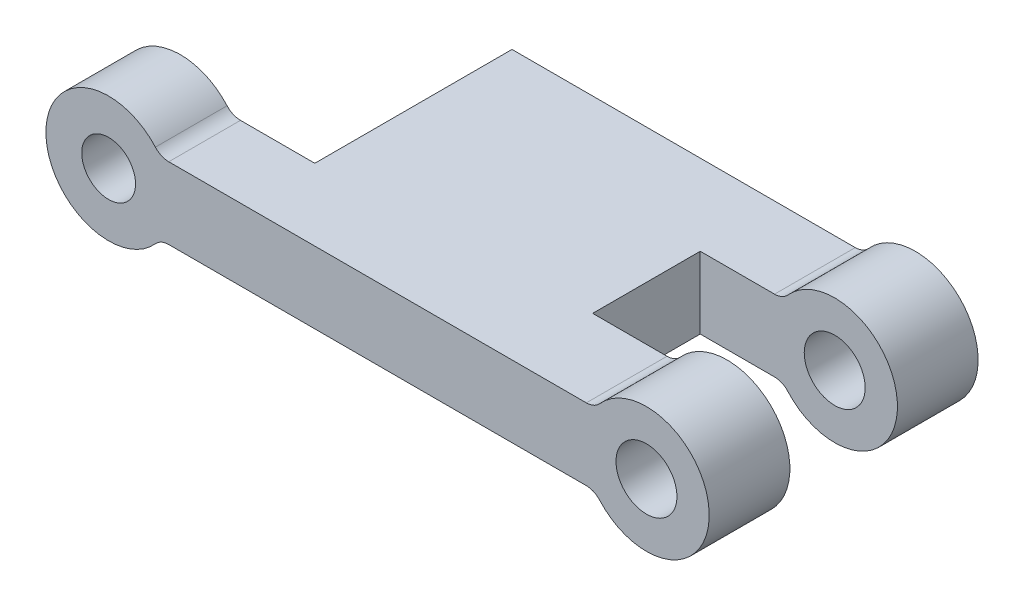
ISO-10303-21;
HEADER;
FILE_DESCRIPTION(('STEP AP214'),'2;1');
FILE_NAME('part.step','',(''),(''),'','','');
FILE_SCHEMA(('AUTOMOTIVE_DESIGN { 1 0 10303 214 1 1 1 1 }'));
ENDSEC;
DATA;
#1=APPLICATION_CONTEXT('core data for automotive mechanical design processes');
#2=APPLICATION_PROTOCOL_DEFINITION('international standard','automotive_design',2000,#1);
#3=PRODUCT_CONTEXT('',#1,'mechanical');
#4=PRODUCT('Part','Part','',(#3));
#5=PRODUCT_RELATED_PRODUCT_CATEGORY('part','',(#4));
#6=PRODUCT_DEFINITION_FORMATION('','',#4);
#7=PRODUCT_DEFINITION_CONTEXT('part definition',#1,'design');
#8=PRODUCT_DEFINITION('design','',#6,#7);
#9=PRODUCT_DEFINITION_SHAPE('','',#8);
#10=(LENGTH_UNIT() NAMED_UNIT(*) SI_UNIT(.MILLI.,.METRE.));
#11=(NAMED_UNIT(*) PLANE_ANGLE_UNIT() SI_UNIT($,.RADIAN.));
#12=(NAMED_UNIT(*) SI_UNIT($,.STERADIAN.) SOLID_ANGLE_UNIT());
#13=UNCERTAINTY_MEASURE_WITH_UNIT(LENGTH_MEASURE(1.E-05),#10,'distance_accuracy_value','');
#14=(GEOMETRIC_REPRESENTATION_CONTEXT(3) GLOBAL_UNCERTAINTY_ASSIGNED_CONTEXT((#13)) GLOBAL_UNIT_ASSIGNED_CONTEXT((#10,
#11,#12)) REPRESENTATION_CONTEXT('',''));
#15=CARTESIAN_POINT('',(0.,0.,0.));
#16=DIRECTION('',(0.,0.,1.));
#17=DIRECTION('',(1.,0.,0.));
#18=AXIS2_PLACEMENT_3D('',#15,#16,#17);
#19=CARTESIAN_POINT('',(22.5,-2.,-11.));
#20=DIRECTION('',(-1.,0.,0.));
#21=DIRECTION('',(0.,0.,1.));
#22=AXIS2_PLACEMENT_3D('',#19,#20,#21);
#23=PLANE('',#22);
#24=DIRECTION('',(0.,0.,1.));
#25=VECTOR('',#24,1.);
#26=CARTESIAN_POINT('',(22.5,2.,-11.));
#27=LINE('',#26,#25);
#28=CARTESIAN_POINT('',(22.5,2.,-6.5));
#29=VERTEX_POINT('',#28);
#30=CARTESIAN_POINT('',(22.5,2.,-0.5));
#31=VERTEX_POINT('',#30);
#32=EDGE_CURVE('E242',#29,#31,#27,.T.);
#33=ORIENTED_EDGE('',*,*,#32,.T.);
#34=DIRECTION('',(0.,1.,0.));
#35=VECTOR('',#34,1.);
#36=CARTESIAN_POINT('',(22.5,2.,-0.5));
#37=LINE('',#36,#35);
#38=CARTESIAN_POINT('',(22.5,-2.,-0.5));
#39=VERTEX_POINT('',#38);
#40=EDGE_CURVE('E183',#39,#31,#37,.T.);
#41=ORIENTED_EDGE('',*,*,#40,.F.);
#42=DIRECTION('',(0.,0.,1.));
#43=VECTOR('',#42,1.);
#44=CARTESIAN_POINT('',(22.5,-2.,-11.));
#45=LINE('',#44,#43);
#46=CARTESIAN_POINT('',(22.5,-2.,-6.5));
#47=VERTEX_POINT('',#46);
#48=EDGE_CURVE('E182',#47,#39,#45,.T.);
#49=ORIENTED_EDGE('',*,*,#48,.F.);
#50=DIRECTION('',(0.,1.,0.));
#51=VECTOR('',#50,1.);
#52=CARTESIAN_POINT('',(22.5,2.,-6.5));
#53=LINE('',#52,#51);
#54=EDGE_CURVE('E209',#47,#29,#53,.T.);
#55=ORIENTED_EDGE('',*,*,#54,.T.);
#56=EDGE_LOOP('',(#33,#41,#49,#55));
#57=FACE_BOUND('',#56,.T.);
#58=ADVANCED_FACE('F35',(#57),#23,.F.);
#59=CARTESIAN_POINT('',(3.35410196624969,-3.,0.));
#60=DIRECTION('',(0.,0.,1.));
#61=DIRECTION('',(1.,0.,0.));
#62=AXIS2_PLACEMENT_3D('',#59,#60,#61);
#63=PLANE('',#62);
#64=CARTESIAN_POINT('',(0.,0.,0.));
#65=DIRECTION('',(0.,0.,1.));
#66=DIRECTION('',(1.,0.,0.));
#67=AXIS2_PLACEMENT_3D('',#64,#65,#66);
#68=CIRCLE('',#67,1.5);
#69=CARTESIAN_POINT('',(1.5,0.,0.));
#70=VERTEX_POINT('',#69);
#71=EDGE_CURVE('E250',#70,#70,#68,.T.);
#72=ORIENTED_EDGE('',*,*,#71,.T.);
#73=EDGE_LOOP('',(#72));
#74=FACE_BOUND('',#73,.T.);
#75=DIRECTION('',(0.,1.,0.));
#76=VECTOR('',#75,1.);
#77=CARTESIAN_POINT('',(7.50000000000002,-2.,0.));
#78=LINE('',#77,#76);
#79=CARTESIAN_POINT('',(7.50000000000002,-2.,0.));
#80=VERTEX_POINT('',#79);
#81=CARTESIAN_POINT('',(7.50000000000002,2.,0.));
#82=VERTEX_POINT('',#81);
#83=EDGE_CURVE('E51',#80,#82,#78,.T.);
#84=ORIENTED_EDGE('',*,*,#83,.F.);
#85=DIRECTION('',(1.,0.,0.));
#86=VECTOR('',#85,1.);
#87=CARTESIAN_POINT('',(3.35410196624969,-2.,0.));
#88=LINE('',#87,#86);
#89=CARTESIAN_POINT('',(3.35410196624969,-2.,0.));
#90=VERTEX_POINT('',#89);
#91=EDGE_CURVE('E136',#90,#80,#88,.T.);
#92=ORIENTED_EDGE('',*,*,#91,.F.);
#93=CARTESIAN_POINT('',(3.35410196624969,-3.,0.));
#94=DIRECTION('',(0.,0.,-1.));
#95=DIRECTION('',(1.,0.,0.));
#96=AXIS2_PLACEMENT_3D('',#93,#94,#95);
#97=CIRCLE('',#96,1.);
#98=CARTESIAN_POINT('',(2.60874597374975,-2.33333333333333,0.));
#99=VERTEX_POINT('',#98);
#100=EDGE_CURVE('E133',#99,#90,#97,.T.);
#101=ORIENTED_EDGE('',*,*,#100,.F.);
#102=CARTESIAN_POINT('',(0.,0.,0.));
#103=DIRECTION('',(0.,0.,1.));
#104=DIRECTION('',(1.,0.,0.));
#105=AXIS2_PLACEMENT_3D('',#102,#103,#104);
#106=CIRCLE('',#105,3.5);
#107=CARTESIAN_POINT('',(2.60874597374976,2.33333333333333,0.));
#108=VERTEX_POINT('',#107);
#109=EDGE_CURVE('E80',#108,#99,#106,.T.);
#110=ORIENTED_EDGE('',*,*,#109,.F.);
#111=CARTESIAN_POINT('',(3.35410196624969,3.,0.));
#112=DIRECTION('',(0.,0.,-1.));
#113=DIRECTION('',(-1.,0.,0.));
#114=AXIS2_PLACEMENT_3D('',#111,#112,#113);
#115=CIRCLE('',#114,1.);
#116=CARTESIAN_POINT('',(3.35410196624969,2.,0.));
#117=VERTEX_POINT('',#116);
#118=EDGE_CURVE('E140',#117,#108,#115,.T.);
#119=ORIENTED_EDGE('',*,*,#118,.F.);
#120=DIRECTION('',(-1.,0.,0.));
#121=VECTOR('',#120,1.);
#122=CARTESIAN_POINT('',(3.35410196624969,2.,0.));
#123=LINE('',#122,#121);
#124=EDGE_CURVE('E121',#82,#117,#123,.T.);
#125=ORIENTED_EDGE('',*,*,#124,.F.);
#126=EDGE_LOOP('',(#84,#92,#101,#110,#119,#125));
#127=FACE_BOUND('',#126,.T.);
#128=ADVANCED_FACE('F343',(#74,#127),#63,.F.);
#129=CARTESIAN_POINT('',(3.35410196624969,-3.,4.));
#130=DIRECTION('',(0.,0.,1.));
#131=DIRECTION('',(1.,0.,0.));
#132=AXIS2_PLACEMENT_3D('',#129,#130,#131);
#133=PLANE('',#132);
#134=CARTESIAN_POINT('',(30.,0.,4.));
#135=DIRECTION('',(0.,0.,1.));
#136=DIRECTION('',(1.,0.,0.));
#137=AXIS2_PLACEMENT_3D('',#134,#135,#136);
#138=CIRCLE('',#137,1.7);
#139=CARTESIAN_POINT('',(31.7,0.,4.));
#140=VERTEX_POINT('',#139);
#141=EDGE_CURVE('E552',#140,#140,#138,.T.);
#142=ORIENTED_EDGE('',*,*,#141,.F.);
#143=EDGE_LOOP('',(#142));
#144=FACE_BOUND('',#143,.T.);
#145=CARTESIAN_POINT('',(3.35410196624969,-3.,4.));
#146=DIRECTION('',(0.,0.,-1.));
#147=DIRECTION('',(1.,0.,0.));
#148=AXIS2_PLACEMENT_3D('',#145,#146,#147);
#149=CIRCLE('',#148,1.);
#150=CARTESIAN_POINT('',(2.60874597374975,-2.33333333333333,4.));
#151=VERTEX_POINT('',#150);
#152=CARTESIAN_POINT('',(3.35410196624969,-2.,4.));
#153=VERTEX_POINT('',#152);
#154=EDGE_CURVE('E143',#151,#153,#149,.T.);
#155=ORIENTED_EDGE('',*,*,#154,.T.);
#156=DIRECTION('',(1.,0.,0.));
#157=VECTOR('',#156,1.);
#158=CARTESIAN_POINT('',(3.35410196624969,-2.,4.));
#159=LINE('',#158,#157);
#160=CARTESIAN_POINT('',(26.6458980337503,-2.,4.));
#161=VERTEX_POINT('',#160);
#162=EDGE_CURVE('E88',#153,#161,#159,.T.);
#163=ORIENTED_EDGE('',*,*,#162,.T.);
#164=CARTESIAN_POINT('',(26.6458980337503,-3.,4.));
#165=DIRECTION('',(0.,0.,-1.));
#166=DIRECTION('',(-1.,0.,0.));
#167=AXIS2_PLACEMENT_3D('',#164,#165,#166);
#168=CIRCLE('',#167,1.);
#169=CARTESIAN_POINT('',(27.3912540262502,-2.33333333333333,4.));
#170=VERTEX_POINT('',#169);
#171=EDGE_CURVE('E164',#161,#170,#168,.T.);
#172=ORIENTED_EDGE('',*,*,#171,.T.);
#173=CARTESIAN_POINT('',(30.,0.,4.));
#174=DIRECTION('',(0.,0.,1.));
#175=DIRECTION('',(1.,0.,0.));
#176=AXIS2_PLACEMENT_3D('',#173,#174,#175);
#177=CIRCLE('',#176,3.5);
#178=CARTESIAN_POINT('',(27.3912540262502,2.33333333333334,4.));
#179=VERTEX_POINT('',#178);
#180=EDGE_CURVE('E258',#170,#179,#177,.T.);
#181=ORIENTED_EDGE('',*,*,#180,.T.);
#182=CARTESIAN_POINT('',(26.6458980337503,3.,4.));
#183=DIRECTION('',(0.,0.,-1.));
#184=DIRECTION('',(1.,0.,0.));
#185=AXIS2_PLACEMENT_3D('',#182,#183,#184);
#186=CIRCLE('',#185,1.);
#187=CARTESIAN_POINT('',(26.6458980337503,2.,4.));
#188=VERTEX_POINT('',#187);
#189=EDGE_CURVE('E112',#179,#188,#186,.T.);
#190=ORIENTED_EDGE('',*,*,#189,.T.);
#191=DIRECTION('',(-1.,0.,0.));
#192=VECTOR('',#191,1.);
#193=CARTESIAN_POINT('',(3.35410196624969,2.,4.));
#194=LINE('',#193,#192);
#195=CARTESIAN_POINT('',(3.35410196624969,2.,4.));
#196=VERTEX_POINT('',#195);
#197=EDGE_CURVE('E104',#188,#196,#194,.T.);
#198=ORIENTED_EDGE('',*,*,#197,.T.);
#199=CARTESIAN_POINT('',(3.35410196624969,3.,4.));
#200=DIRECTION('',(0.,0.,-1.));
#201=DIRECTION('',(-1.,0.,0.));
#202=AXIS2_PLACEMENT_3D('',#199,#200,#201);
#203=CIRCLE('',#202,1.);
#204=CARTESIAN_POINT('',(2.60874597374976,2.33333333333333,4.));
#205=VERTEX_POINT('',#204);
#206=EDGE_CURVE('E109',#196,#205,#203,.T.);
#207=ORIENTED_EDGE('',*,*,#206,.T.);
#208=CARTESIAN_POINT('',(0.,0.,4.));
#209=DIRECTION('',(0.,0.,1.));
#210=DIRECTION('',(1.,0.,0.));
#211=AXIS2_PLACEMENT_3D('',#208,#209,#210);
#212=CIRCLE('',#211,3.5);
#213=EDGE_CURVE('E60',#205,#151,#212,.T.);
#214=ORIENTED_EDGE('',*,*,#213,.T.);
#215=EDGE_LOOP('',(#155,#163,#172,#181,#190,#198,#207,#214));
#216=FACE_BOUND('',#215,.T.);
#217=CARTESIAN_POINT('',(0.,0.,4.));
#218=DIRECTION('',(0.,0.,1.));
#219=DIRECTION('',(1.,0.,0.));
#220=AXIS2_PLACEMENT_3D('',#217,#218,#219);
#221=CIRCLE('',#220,1.5);
#222=CARTESIAN_POINT('',(1.5,0.,4.));
#223=VERTEX_POINT('',#222);
#224=EDGE_CURVE('E137',#223,#223,#221,.T.);
#225=ORIENTED_EDGE('',*,*,#224,.F.);
#226=EDGE_LOOP('',(#225));
#227=FACE_BOUND('',#226,.T.);
#228=ADVANCED_FACE('F106',(#144,#216,#227),#133,.T.);
#229=CARTESIAN_POINT('',(3.35410196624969,-3.,4.));
#230=DIRECTION('',(0.,0.,-1.));
#231=DIRECTION('',(-1.,0.,0.));
#232=AXIS2_PLACEMENT_3D('',#229,#230,#231);
#233=CYLINDRICAL_SURFACE('',#232,1.);
#234=ORIENTED_EDGE('',*,*,#100,.T.);
#235=DIRECTION('',(0.,0.,-1.));
#236=VECTOR('',#235,1.);
#237=CARTESIAN_POINT('',(3.35410196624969,-2.,4.));
#238=LINE('',#237,#236);
#239=EDGE_CURVE('E11',#153,#90,#238,.T.);
#240=ORIENTED_EDGE('',*,*,#239,.F.);
#241=ORIENTED_EDGE('',*,*,#154,.F.);
#242=DIRECTION('',(0.,0.,-1.));
#243=VECTOR('',#242,1.);
#244=CARTESIAN_POINT('',(2.60874597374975,-2.33333333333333,4.));
#245=LINE('',#244,#243);
#246=EDGE_CURVE('E129',#151,#99,#245,.T.);
#247=ORIENTED_EDGE('',*,*,#246,.T.);
#248=EDGE_LOOP('',(#234,#240,#241,#247));
#249=FACE_BOUND('',#248,.T.);
#250=ADVANCED_FACE('F37',(#249),#233,.F.);
#251=CARTESIAN_POINT('',(3.35410196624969,-2.,4.));
#252=DIRECTION('',(0.,1.,0.));
#253=DIRECTION('',(0.,0.,1.));
#254=AXIS2_PLACEMENT_3D('',#251,#252,#253);
#255=PLANE('',#254);
#256=ORIENTED_EDGE('',*,*,#91,.T.);
#257=DIRECTION('',(0.,0.,1.));
#258=VECTOR('',#257,1.);
#259=CARTESIAN_POINT('',(7.50000000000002,-2.,-11.));
#260=LINE('',#259,#258);
#261=CARTESIAN_POINT('',(7.50000000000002,-2.,-11.));
#262=VERTEX_POINT('',#261);
#263=EDGE_CURVE('E247',#262,#80,#260,.T.);
#264=ORIENTED_EDGE('',*,*,#263,.F.);
#265=DIRECTION('',(-1.,0.,0.));
#266=VECTOR('',#265,1.);
#267=CARTESIAN_POINT('',(7.50000000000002,-2.,-11.));
#268=LINE('',#267,#266);
#269=CARTESIAN_POINT('',(26.6458980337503,-2.,-11.));
#270=VERTEX_POINT('',#269);
#271=EDGE_CURVE('E231',#270,#262,#268,.T.);
#272=ORIENTED_EDGE('',*,*,#271,.F.);
#273=DIRECTION('',(0.,0.,-1.));
#274=VECTOR('',#273,1.);
#275=CARTESIAN_POINT('',(26.6458980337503,-2.,-6.5));
#276=LINE('',#275,#274);
#277=CARTESIAN_POINT('',(26.6458980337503,-2.,-6.5));
#278=VERTEX_POINT('',#277);
#279=EDGE_CURVE('E220',#278,#270,#276,.T.);
#280=ORIENTED_EDGE('',*,*,#279,.F.);
#281=DIRECTION('',(-1.,0.,0.));
#282=VECTOR('',#281,1.);
#283=CARTESIAN_POINT('',(22.5,-2.,-6.5));
#284=LINE('',#283,#282);
#285=EDGE_CURVE('E207',#278,#47,#284,.T.);
#286=ORIENTED_EDGE('',*,*,#285,.T.);
#287=ORIENTED_EDGE('',*,*,#48,.T.);
#288=DIRECTION('',(-1.,0.,0.));
#289=VECTOR('',#288,1.);
#290=CARTESIAN_POINT('',(22.5,-2.,-0.5));
#291=LINE('',#290,#289);
#292=CARTESIAN_POINT('',(26.6458980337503,-2.,-0.5));
#293=VERTEX_POINT('',#292);
#294=EDGE_CURVE('E172',#293,#39,#291,.T.);
#295=ORIENTED_EDGE('',*,*,#294,.F.);
#296=DIRECTION('',(0.,0.,-1.));
#297=VECTOR('',#296,1.);
#298=CARTESIAN_POINT('',(26.6458980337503,-2.,4.));
#299=LINE('',#298,#297);
#300=EDGE_CURVE('E44',#161,#293,#299,.T.);
#301=ORIENTED_EDGE('',*,*,#300,.F.);
#302=ORIENTED_EDGE('',*,*,#162,.F.);
#303=ORIENTED_EDGE('',*,*,#239,.T.);
#304=EDGE_LOOP('',(#256,#264,#272,#280,#286,#287,#295,#301,#302,#303));
#305=FACE_BOUND('',#304,.T.);
#306=ADVANCED_FACE('F179',(#305),#255,.F.);
#307=CARTESIAN_POINT('',(26.6458980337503,-3.,4.));
#308=DIRECTION('',(0.,0.,-1.));
#309=DIRECTION('',(-1.,0.,0.));
#310=AXIS2_PLACEMENT_3D('',#307,#308,#309);
#311=CYLINDRICAL_SURFACE('',#310,1.);
#312=ORIENTED_EDGE('',*,*,#300,.T.);
#313=CARTESIAN_POINT('',(26.6458980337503,-3.,-0.5));
#314=DIRECTION('',(0.,0.,1.));
#315=DIRECTION('',(-1.,0.,0.));
#316=AXIS2_PLACEMENT_3D('',#313,#314,#315);
#317=CIRCLE('',#316,1.);
#318=CARTESIAN_POINT('',(27.3912540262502,-2.33333333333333,-0.5));
#319=VERTEX_POINT('',#318);
#320=EDGE_CURVE('E162',#319,#293,#317,.T.);
#321=ORIENTED_EDGE('',*,*,#320,.F.);
#322=DIRECTION('',(0.,0.,-1.));
#323=VECTOR('',#322,1.);
#324=CARTESIAN_POINT('',(27.3912540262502,-2.33333333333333,4.));
#325=LINE('',#324,#323);
#326=EDGE_CURVE('E150',#170,#319,#325,.T.);
#327=ORIENTED_EDGE('',*,*,#326,.F.);
#328=ORIENTED_EDGE('',*,*,#171,.F.);
#329=EDGE_LOOP('',(#312,#321,#327,#328));
#330=FACE_BOUND('',#329,.T.);
#331=ADVANCED_FACE('F159',(#330),#311,.F.);
#332=CARTESIAN_POINT('',(30.,0.,4.));
#333=DIRECTION('',(0.,0.,-1.));
#334=DIRECTION('',(-1.,0.,0.));
#335=AXIS2_PLACEMENT_3D('',#332,#333,#334);
#336=CYLINDRICAL_SURFACE('',#335,3.5);
#337=ORIENTED_EDGE('',*,*,#326,.T.);
#338=CARTESIAN_POINT('',(30.,0.,-0.5));
#339=DIRECTION('',(0.,0.,-1.));
#340=DIRECTION('',(-1.,0.,0.));
#341=AXIS2_PLACEMENT_3D('',#338,#339,#340);
#342=CIRCLE('',#341,3.5);
#343=CARTESIAN_POINT('',(27.3912540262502,2.33333333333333,-0.5));
#344=VERTEX_POINT('',#343);
#345=EDGE_CURVE('E176',#344,#319,#342,.T.);
#346=ORIENTED_EDGE('',*,*,#345,.F.);
#347=DIRECTION('',(0.,0.,-1.));
#348=VECTOR('',#347,1.);
#349=CARTESIAN_POINT('',(27.3912540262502,2.33333333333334,4.));
#350=LINE('',#349,#348);
#351=EDGE_CURVE('E147',#179,#344,#350,.T.);
#352=ORIENTED_EDGE('',*,*,#351,.F.);
#353=ORIENTED_EDGE('',*,*,#180,.F.);
#354=EDGE_LOOP('',(#337,#346,#352,#353));
#355=FACE_BOUND('',#354,.T.);
#356=ADVANCED_FACE('F262',(#355),#336,.T.);
#357=CARTESIAN_POINT('',(26.6458980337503,3.,4.));
#358=DIRECTION('',(0.,0.,-1.));
#359=DIRECTION('',(-1.,0.,0.));
#360=AXIS2_PLACEMENT_3D('',#357,#358,#359);
#361=CYLINDRICAL_SURFACE('',#360,1.);
#362=ORIENTED_EDGE('',*,*,#351,.T.);
#363=CARTESIAN_POINT('',(26.6458980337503,3.,-0.5));
#364=DIRECTION('',(0.,0.,1.));
#365=DIRECTION('',(-1.,0.,0.));
#366=AXIS2_PLACEMENT_3D('',#363,#364,#365);
#367=CIRCLE('',#366,0.999999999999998);
#368=CARTESIAN_POINT('',(26.6458980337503,2.,-0.5));
#369=VERTEX_POINT('',#368);
#370=EDGE_CURVE('E191',#369,#344,#367,.T.);
#371=ORIENTED_EDGE('',*,*,#370,.F.);
#372=DIRECTION('',(0.,0.,-1.));
#373=VECTOR('',#372,1.);
#374=CARTESIAN_POINT('',(26.6458980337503,2.,4.));
#375=LINE('',#374,#373);
#376=EDGE_CURVE('E124',#188,#369,#375,.T.);
#377=ORIENTED_EDGE('',*,*,#376,.F.);
#378=ORIENTED_EDGE('',*,*,#189,.F.);
#379=EDGE_LOOP('',(#362,#371,#377,#378));
#380=FACE_BOUND('',#379,.T.);
#381=ADVANCED_FACE('F266',(#380),#361,.F.);
#382=CARTESIAN_POINT('',(3.35410196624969,2.,4.));
#383=DIRECTION('',(0.,-1.,0.));
#384=DIRECTION('',(0.,0.,-1.));
#385=AXIS2_PLACEMENT_3D('',#382,#383,#384);
#386=PLANE('',#385);
#387=ORIENTED_EDGE('',*,*,#376,.T.);
#388=DIRECTION('',(1.,0.,0.));
#389=VECTOR('',#388,1.);
#390=CARTESIAN_POINT('',(26.6458980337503,2.,-0.5));
#391=LINE('',#390,#389);
#392=EDGE_CURVE('E185',#31,#369,#391,.T.);
#393=ORIENTED_EDGE('',*,*,#392,.F.);
#394=ORIENTED_EDGE('',*,*,#32,.F.);
#395=DIRECTION('',(1.,0.,0.));
#396=VECTOR('',#395,1.);
#397=CARTESIAN_POINT('',(26.6458980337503,2.,-6.5));
#398=LINE('',#397,#396);
#399=CARTESIAN_POINT('',(26.6458980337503,2.,-6.5));
#400=VERTEX_POINT('',#399);
#401=EDGE_CURVE('E194',#29,#400,#398,.T.);
#402=ORIENTED_EDGE('',*,*,#401,.T.);
#403=DIRECTION('',(0.,0.,-1.));
#404=VECTOR('',#403,1.);
#405=CARTESIAN_POINT('',(26.6458980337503,2.,-6.5));
#406=LINE('',#405,#404);
#407=CARTESIAN_POINT('',(26.6458980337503,2.,-11.));
#408=VERTEX_POINT('',#407);
#409=EDGE_CURVE('E212',#400,#408,#406,.T.);
#410=ORIENTED_EDGE('',*,*,#409,.T.);
#411=DIRECTION('',(1.,0.,0.));
#412=VECTOR('',#411,1.);
#413=CARTESIAN_POINT('',(7.50000000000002,2.,-11.));
#414=LINE('',#413,#412);
#415=CARTESIAN_POINT('',(7.50000000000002,2.,-11.));
#416=VERTEX_POINT('',#415);
#417=EDGE_CURVE('E237',#416,#408,#414,.T.);
#418=ORIENTED_EDGE('',*,*,#417,.F.);
#419=DIRECTION('',(0.,0.,1.));
#420=VECTOR('',#419,1.);
#421=CARTESIAN_POINT('',(7.50000000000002,2.,-11.));
#422=LINE('',#421,#420);
#423=EDGE_CURVE('E245',#416,#82,#422,.T.);
#424=ORIENTED_EDGE('',*,*,#423,.T.);
#425=ORIENTED_EDGE('',*,*,#124,.T.);
#426=DIRECTION('',(0.,0.,-1.));
#427=VECTOR('',#426,1.);
#428=CARTESIAN_POINT('',(3.35410196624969,2.,4.));
#429=LINE('',#428,#427);
#430=EDGE_CURVE('E118',#196,#117,#429,.T.);
#431=ORIENTED_EDGE('',*,*,#430,.F.);
#432=ORIENTED_EDGE('',*,*,#197,.F.);
#433=EDGE_LOOP('',(#387,#393,#394,#402,#410,#418,#424,#425,#431,#432));
#434=FACE_BOUND('',#433,.T.);
#435=ADVANCED_FACE('F119',(#434),#386,.F.);
#436=CARTESIAN_POINT('',(3.35410196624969,3.,4.));
#437=DIRECTION('',(0.,0.,-1.));
#438=DIRECTION('',(-1.,0.,0.));
#439=AXIS2_PLACEMENT_3D('',#436,#437,#438);
#440=CYLINDRICAL_SURFACE('',#439,1.);
#441=ORIENTED_EDGE('',*,*,#118,.T.);
#442=DIRECTION('',(0.,0.,-1.));
#443=VECTOR('',#442,1.);
#444=CARTESIAN_POINT('',(2.60874597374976,2.33333333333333,4.));
#445=LINE('',#444,#443);
#446=EDGE_CURVE('E125',#205,#108,#445,.T.);
#447=ORIENTED_EDGE('',*,*,#446,.F.);
#448=ORIENTED_EDGE('',*,*,#206,.F.);
#449=ORIENTED_EDGE('',*,*,#430,.T.);
#450=EDGE_LOOP('',(#441,#447,#448,#449));
#451=FACE_BOUND('',#450,.T.);
#452=ADVANCED_FACE('F127',(#451),#440,.F.);
#453=CARTESIAN_POINT('',(0.,0.,4.));
#454=DIRECTION('',(0.,0.,-1.));
#455=DIRECTION('',(-1.,0.,0.));
#456=AXIS2_PLACEMENT_3D('',#453,#454,#455);
#457=CYLINDRICAL_SURFACE('',#456,3.5);
#458=ORIENTED_EDGE('',*,*,#109,.T.);
#459=ORIENTED_EDGE('',*,*,#246,.F.);
#460=ORIENTED_EDGE('',*,*,#213,.F.);
#461=ORIENTED_EDGE('',*,*,#446,.T.);
#462=EDGE_LOOP('',(#458,#459,#460,#461));
#463=FACE_BOUND('',#462,.T.);
#464=ADVANCED_FACE('F357',(#463),#457,.T.);
#465=CARTESIAN_POINT('',(0.,0.,4.));
#466=DIRECTION('',(0.,0.,-1.));
#467=DIRECTION('',(-1.,0.,0.));
#468=AXIS2_PLACEMENT_3D('',#465,#466,#467);
#469=CYLINDRICAL_SURFACE('',#468,1.5);
#470=ORIENTED_EDGE('',*,*,#224,.T.);
#471=EDGE_LOOP('',(#470));
#472=FACE_BOUND('',#471,.T.);
#473=ORIENTED_EDGE('',*,*,#71,.F.);
#474=EDGE_LOOP('',(#473));
#475=FACE_BOUND('',#474,.T.);
#476=ADVANCED_FACE('F354',(#472,#475),#469,.F.);
#477=CARTESIAN_POINT('',(7.50000000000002,-2.,-11.));
#478=DIRECTION('',(1.,0.,0.));
#479=DIRECTION('',(0.,0.,-1.));
#480=AXIS2_PLACEMENT_3D('',#477,#478,#479);
#481=PLANE('',#480);
#482=ORIENTED_EDGE('',*,*,#83,.T.);
#483=ORIENTED_EDGE('',*,*,#423,.F.);
#484=DIRECTION('',(0.,1.,0.));
#485=VECTOR('',#484,1.);
#486=CARTESIAN_POINT('',(7.50000000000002,-2.,-11.));
#487=LINE('',#486,#485);
#488=EDGE_CURVE('E234',#262,#416,#487,.T.);
#489=ORIENTED_EDGE('',*,*,#488,.F.);
#490=ORIENTED_EDGE('',*,*,#263,.T.);
#491=EDGE_LOOP('',(#482,#483,#489,#490));
#492=FACE_BOUND('',#491,.T.);
#493=ADVANCED_FACE('F312',(#492),#481,.F.);
#494=CARTESIAN_POINT('',(0.,0.,-11.));
#495=DIRECTION('',(0.,0.,1.));
#496=DIRECTION('',(1.,0.,0.));
#497=AXIS2_PLACEMENT_3D('',#494,#495,#496);
#498=PLANE('',#497);
#499=CARTESIAN_POINT('',(30.,0.,-11.));
#500=DIRECTION('',(0.,0.,1.));
#501=DIRECTION('',(1.,0.,0.));
#502=AXIS2_PLACEMENT_3D('',#499,#500,#501);
#503=CIRCLE('',#502,1.69999999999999);
#504=CARTESIAN_POINT('',(31.7,0.,-11.));
#505=VERTEX_POINT('',#504);
#506=EDGE_CURVE('E553',#505,#505,#503,.T.);
#507=ORIENTED_EDGE('',*,*,#506,.T.);
#508=EDGE_LOOP('',(#507));
#509=FACE_BOUND('',#508,.T.);
#510=ORIENTED_EDGE('',*,*,#271,.T.);
#511=ORIENTED_EDGE('',*,*,#488,.T.);
#512=ORIENTED_EDGE('',*,*,#417,.T.);
#513=CARTESIAN_POINT('',(26.6458980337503,3.,-11.));
#514=DIRECTION('',(0.,0.,1.));
#515=DIRECTION('',(-1.,0.,0.));
#516=AXIS2_PLACEMENT_3D('',#513,#514,#515);
#517=CIRCLE('',#516,0.999999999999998);
#518=CARTESIAN_POINT('',(27.3912540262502,2.33333333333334,-11.));
#519=VERTEX_POINT('',#518);
#520=EDGE_CURVE('E193',#408,#519,#517,.T.);
#521=ORIENTED_EDGE('',*,*,#520,.T.);
#522=CARTESIAN_POINT('',(30.,0.,-11.));
#523=DIRECTION('',(0.,0.,-1.));
#524=DIRECTION('',(-1.,0.,0.));
#525=AXIS2_PLACEMENT_3D('',#522,#523,#524);
#526=CIRCLE('',#525,3.5);
#527=CARTESIAN_POINT('',(27.3912540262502,-2.33333333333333,-11.));
#528=VERTEX_POINT('',#527);
#529=EDGE_CURVE('E215',#519,#528,#526,.T.);
#530=ORIENTED_EDGE('',*,*,#529,.T.);
#531=CARTESIAN_POINT('',(26.6458980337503,-3.,-11.));
#532=DIRECTION('',(0.,0.,1.));
#533=DIRECTION('',(-1.,0.,0.));
#534=AXIS2_PLACEMENT_3D('',#531,#532,#533);
#535=CIRCLE('',#534,1.);
#536=EDGE_CURVE('E198',#528,#270,#535,.T.);
#537=ORIENTED_EDGE('',*,*,#536,.T.);
#538=EDGE_LOOP('',(#510,#511,#512,#521,#530,#537));
#539=FACE_BOUND('',#538,.T.);
#540=ADVANCED_FACE('F308',(#509,#539),#498,.F.);
#541=CARTESIAN_POINT('',(26.6458980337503,-3.,-6.5));
#542=DIRECTION('',(0.,0.,-1.));
#543=DIRECTION('',(-1.,0.,0.));
#544=AXIS2_PLACEMENT_3D('',#541,#542,#543);
#545=CYLINDRICAL_SURFACE('',#544,1.);
#546=ORIENTED_EDGE('',*,*,#536,.F.);
#547=DIRECTION('',(0.,0.,-1.));
#548=VECTOR('',#547,1.);
#549=CARTESIAN_POINT('',(27.3912540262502,-2.33333333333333,-6.5));
#550=LINE('',#549,#548);
#551=CARTESIAN_POINT('',(27.3912540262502,-2.33333333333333,-6.5));
#552=VERTEX_POINT('',#551);
#553=EDGE_CURVE('E223',#552,#528,#550,.T.);
#554=ORIENTED_EDGE('',*,*,#553,.F.);
#555=CARTESIAN_POINT('',(26.6458980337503,-3.,-6.5));
#556=DIRECTION('',(0.,0.,1.));
#557=DIRECTION('',(-1.,0.,0.));
#558=AXIS2_PLACEMENT_3D('',#555,#556,#557);
#559=CIRCLE('',#558,1.);
#560=EDGE_CURVE('E204',#552,#278,#559,.T.);
#561=ORIENTED_EDGE('',*,*,#560,.T.);
#562=ORIENTED_EDGE('',*,*,#279,.T.);
#563=EDGE_LOOP('',(#546,#554,#561,#562));
#564=FACE_BOUND('',#563,.T.);
#565=ADVANCED_FACE('F324',(#564),#545,.F.);
#566=CARTESIAN_POINT('',(30.,0.,-6.5));
#567=DIRECTION('',(0.,0.,-1.));
#568=DIRECTION('',(-1.,0.,0.));
#569=AXIS2_PLACEMENT_3D('',#566,#567,#568);
#570=CYLINDRICAL_SURFACE('',#569,3.5);
#571=ORIENTED_EDGE('',*,*,#529,.F.);
#572=DIRECTION('',(0.,0.,-1.));
#573=VECTOR('',#572,1.);
#574=CARTESIAN_POINT('',(27.3912540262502,2.33333333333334,-6.5));
#575=LINE('',#574,#573);
#576=CARTESIAN_POINT('',(27.3912540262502,2.33333333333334,-6.5));
#577=VERTEX_POINT('',#576);
#578=EDGE_CURVE('E226',#577,#519,#575,.T.);
#579=ORIENTED_EDGE('',*,*,#578,.F.);
#580=CARTESIAN_POINT('',(30.,0.,-6.5));
#581=DIRECTION('',(0.,0.,-1.));
#582=DIRECTION('',(-1.,0.,0.));
#583=AXIS2_PLACEMENT_3D('',#580,#581,#582);
#584=CIRCLE('',#583,3.5);
#585=EDGE_CURVE('E201',#577,#552,#584,.T.);
#586=ORIENTED_EDGE('',*,*,#585,.T.);
#587=ORIENTED_EDGE('',*,*,#553,.T.);
#588=EDGE_LOOP('',(#571,#579,#586,#587));
#589=FACE_BOUND('',#588,.T.);
#590=ADVANCED_FACE('F320',(#589),#570,.T.);
#591=CARTESIAN_POINT('',(26.6458980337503,3.,-6.5));
#592=DIRECTION('',(0.,0.,-1.));
#593=DIRECTION('',(-1.,0.,0.));
#594=AXIS2_PLACEMENT_3D('',#591,#592,#593);
#595=CYLINDRICAL_SURFACE('',#594,0.999999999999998);
#596=ORIENTED_EDGE('',*,*,#520,.F.);
#597=ORIENTED_EDGE('',*,*,#409,.F.);
#598=CARTESIAN_POINT('',(26.6458980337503,3.,-6.5));
#599=DIRECTION('',(0.,0.,1.));
#600=DIRECTION('',(-1.,0.,0.));
#601=AXIS2_PLACEMENT_3D('',#598,#599,#600);
#602=CIRCLE('',#601,0.999999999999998);
#603=EDGE_CURVE('E197',#400,#577,#602,.T.);
#604=ORIENTED_EDGE('',*,*,#603,.T.);
#605=ORIENTED_EDGE('',*,*,#578,.T.);
#606=EDGE_LOOP('',(#596,#597,#604,#605));
#607=FACE_BOUND('',#606,.T.);
#608=ADVANCED_FACE('F316',(#607),#595,.F.);
#609=CARTESIAN_POINT('',(26.6458980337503,-3.,-6.5));
#610=DIRECTION('',(0.,0.,-1.));
#611=DIRECTION('',(-1.,0.,0.));
#612=AXIS2_PLACEMENT_3D('',#609,#610,#611);
#613=PLANE('',#612);
#614=CARTESIAN_POINT('',(30.,0.,-6.5));
#615=DIRECTION('',(0.,0.,-1.));
#616=DIRECTION('',(-1.,0.,0.));
#617=AXIS2_PLACEMENT_3D('',#614,#615,#616);
#618=CIRCLE('',#617,1.7);
#619=CARTESIAN_POINT('',(28.3,0.,-6.5));
#620=VERTEX_POINT('',#619);
#621=EDGE_CURVE('E39',#620,#620,#618,.T.);
#622=ORIENTED_EDGE('',*,*,#621,.T.);
#623=EDGE_LOOP('',(#622));
#624=FACE_BOUND('',#623,.T.);
#625=ORIENTED_EDGE('',*,*,#401,.F.);
#626=ORIENTED_EDGE('',*,*,#54,.F.);
#627=ORIENTED_EDGE('',*,*,#285,.F.);
#628=ORIENTED_EDGE('',*,*,#560,.F.);
#629=ORIENTED_EDGE('',*,*,#585,.F.);
#630=ORIENTED_EDGE('',*,*,#603,.F.);
#631=EDGE_LOOP('',(#625,#626,#627,#628,#629,#630));
#632=FACE_BOUND('',#631,.T.);
#633=ADVANCED_FACE('F328',(#624,#632),#613,.F.);
#634=CARTESIAN_POINT('',(30.,0.,-0.5));
#635=DIRECTION('',(0.,0.,-1.));
#636=DIRECTION('',(-1.,0.,0.));
#637=AXIS2_PLACEMENT_3D('',#634,#635,#636);
#638=PLANE('',#637);
#639=CARTESIAN_POINT('',(30.,0.,-0.5));
#640=DIRECTION('',(0.,0.,-1.));
#641=DIRECTION('',(-1.,0.,0.));
#642=AXIS2_PLACEMENT_3D('',#639,#640,#641);
#643=CIRCLE('',#642,1.7);
#644=CARTESIAN_POINT('',(28.3,0.,-0.5));
#645=VERTEX_POINT('',#644);
#646=EDGE_CURVE('E549',#645,#645,#643,.T.);
#647=ORIENTED_EDGE('',*,*,#646,.F.);
#648=EDGE_LOOP('',(#647));
#649=FACE_BOUND('',#648,.T.);
#650=ORIENTED_EDGE('',*,*,#345,.T.);
#651=ORIENTED_EDGE('',*,*,#320,.T.);
#652=ORIENTED_EDGE('',*,*,#294,.T.);
#653=ORIENTED_EDGE('',*,*,#40,.T.);
#654=ORIENTED_EDGE('',*,*,#392,.T.);
#655=ORIENTED_EDGE('',*,*,#370,.T.);
#656=EDGE_LOOP('',(#650,#651,#652,#653,#654,#655));
#657=FACE_BOUND('',#656,.T.);
#658=ADVANCED_FACE('F170',(#649,#657),#638,.T.);
#659=CARTESIAN_POINT('',(30.,0.,4.));
#660=DIRECTION('',(0.,0.,1.));
#661=DIRECTION('',(1.,0.,0.));
#662=AXIS2_PLACEMENT_3D('',#659,#660,#661);
#663=CYLINDRICAL_SURFACE('',#662,1.7);
#664=ORIENTED_EDGE('',*,*,#506,.F.);
#665=EDGE_LOOP('',(#664));
#666=FACE_BOUND('',#665,.T.);
#667=ORIENTED_EDGE('',*,*,#621,.F.);
#668=EDGE_LOOP('',(#667));
#669=FACE_BOUND('',#668,.T.);
#670=ADVANCED_FACE('F336',(#666,#669),#663,.F.);
#671=ORIENTED_EDGE('',*,*,#646,.T.);
#672=EDGE_LOOP('',(#671));
#673=FACE_BOUND('',#672,.T.);
#674=ORIENTED_EDGE('',*,*,#141,.T.);
#675=EDGE_LOOP('',(#674));
#676=FACE_BOUND('',#675,.T.);
#677=ADVANCED_FACE('F530',(#673,#676),#663,.F.);
#678=CLOSED_SHELL('',(#58,#128,#228,#250,#306,#331,#356,#381,#435,#452,#464,#476,#493,#540,#565,
#590,#608,#633,#658,#670,#677));
#679=MANIFOLD_SOLID_BREP('B2',#678);
#680=ADVANCED_BREP_SHAPE_REPRESENTATION('',(#18,#679),#14);
#681=SHAPE_DEFINITION_REPRESENTATION(#9,#680);
ENDSEC;
END-ISO-10303-21;
